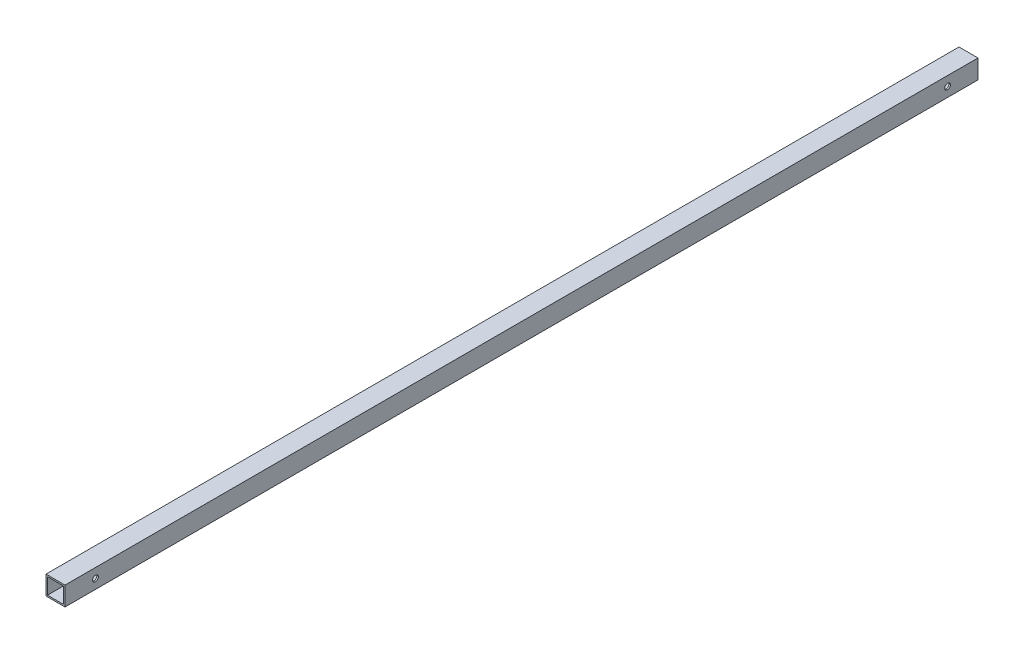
ISO-10303-21;
HEADER;
FILE_DESCRIPTION(('STEP AP214'),'2;1');
FILE_NAME('part.step','',(''),(''),'','','');
FILE_SCHEMA(('AUTOMOTIVE_DESIGN { 1 0 10303 214 1 1 1 1 }'));
ENDSEC;
DATA;
#1=APPLICATION_CONTEXT('core data for automotive mechanical design processes');
#2=APPLICATION_PROTOCOL_DEFINITION('international standard','automotive_design',2000,#1);
#3=PRODUCT_CONTEXT('',#1,'mechanical');
#4=PRODUCT('Part','Part','',(#3));
#5=PRODUCT_RELATED_PRODUCT_CATEGORY('part','',(#4));
#6=PRODUCT_DEFINITION_FORMATION('','',#4);
#7=PRODUCT_DEFINITION_CONTEXT('part definition',#1,'design');
#8=PRODUCT_DEFINITION('design','',#6,#7);
#9=PRODUCT_DEFINITION_SHAPE('','',#8);
#10=(LENGTH_UNIT() NAMED_UNIT(*) SI_UNIT(.MILLI.,.METRE.));
#11=(NAMED_UNIT(*) PLANE_ANGLE_UNIT() SI_UNIT($,.RADIAN.));
#12=(NAMED_UNIT(*) SI_UNIT($,.STERADIAN.) SOLID_ANGLE_UNIT());
#13=UNCERTAINTY_MEASURE_WITH_UNIT(LENGTH_MEASURE(1.E-05),#10,'distance_accuracy_value','');
#14=(GEOMETRIC_REPRESENTATION_CONTEXT(3) GLOBAL_UNCERTAINTY_ASSIGNED_CONTEXT((#13)) GLOBAL_UNIT_ASSIGNED_CONTEXT((#10,
#11,#12)) REPRESENTATION_CONTEXT('',''));
#15=CARTESIAN_POINT('',(0.,0.,0.));
#16=DIRECTION('',(0.,0.,1.));
#17=DIRECTION('',(1.,0.,0.));
#18=AXIS2_PLACEMENT_3D('',#15,#16,#17);
#19=CARTESIAN_POINT('',(0.,0.,762.));
#20=DIRECTION('',(0.,0.,-1.));
#21=DIRECTION('',(-1.,0.,0.));
#22=AXIS2_PLACEMENT_3D('',#19,#20,#21);
#23=PLANE('',#22);
#24=DIRECTION('',(0.,1.,0.));
#25=VECTOR('',#24,1.);
#26=CARTESIAN_POINT('',(15.875,-15.875,762.));
#27=LINE('',#26,#25);
#28=CARTESIAN_POINT('',(15.875,-15.875,762.));
#29=VERTEX_POINT('',#28);
#30=CARTESIAN_POINT('',(15.875,15.875,762.));
#31=VERTEX_POINT('',#30);
#32=EDGE_CURVE('E138',#29,#31,#27,.T.);
#33=ORIENTED_EDGE('',*,*,#32,.T.);
#34=DIRECTION('',(-1.,0.,0.));
#35=VECTOR('',#34,1.);
#36=CARTESIAN_POINT('',(-15.875,15.875,762.));
#37=LINE('',#36,#35);
#38=CARTESIAN_POINT('',(-15.875,15.875,762.));
#39=VERTEX_POINT('',#38);
#40=EDGE_CURVE('E141',#31,#39,#37,.T.);
#41=ORIENTED_EDGE('',*,*,#40,.T.);
#42=DIRECTION('',(0.,-1.,0.));
#43=VECTOR('',#42,1.);
#44=CARTESIAN_POINT('',(-15.875,-15.875,762.));
#45=LINE('',#44,#43);
#46=CARTESIAN_POINT('',(-15.875,-15.875,762.));
#47=VERTEX_POINT('',#46);
#48=EDGE_CURVE('E144',#39,#47,#45,.T.);
#49=ORIENTED_EDGE('',*,*,#48,.T.);
#50=DIRECTION('',(1.,0.,0.));
#51=VECTOR('',#50,1.);
#52=CARTESIAN_POINT('',(-15.875,-15.875,762.));
#53=LINE('',#52,#51);
#54=EDGE_CURVE('E146',#47,#29,#53,.T.);
#55=ORIENTED_EDGE('',*,*,#54,.T.);
#56=EDGE_LOOP('',(#33,#41,#49,#55));
#57=FACE_BOUND('',#56,.T.);
#58=DIRECTION('',(0.,-1.,0.));
#59=VECTOR('',#58,1.);
#60=CARTESIAN_POINT('',(-13.335,-13.335,762.));
#61=LINE('',#60,#59);
#62=CARTESIAN_POINT('',(-13.335,13.335,762.));
#63=VERTEX_POINT('',#62);
#64=CARTESIAN_POINT('',(-13.335,-13.335,762.));
#65=VERTEX_POINT('',#64);
#66=EDGE_CURVE('E100',#63,#65,#61,.T.);
#67=ORIENTED_EDGE('',*,*,#66,.F.);
#68=DIRECTION('',(-1.,0.,0.));
#69=VECTOR('',#68,1.);
#70=CARTESIAN_POINT('',(-13.335,13.335,762.));
#71=LINE('',#70,#69);
#72=CARTESIAN_POINT('',(13.335,13.335,762.));
#73=VERTEX_POINT('',#72);
#74=EDGE_CURVE('E122',#73,#63,#71,.T.);
#75=ORIENTED_EDGE('',*,*,#74,.F.);
#76=DIRECTION('',(0.,1.,0.));
#77=VECTOR('',#76,1.);
#78=CARTESIAN_POINT('',(13.335,-13.335,762.));
#79=LINE('',#78,#77);
#80=CARTESIAN_POINT('',(13.335,-13.335,762.));
#81=VERTEX_POINT('',#80);
#82=EDGE_CURVE('E120',#81,#73,#79,.T.);
#83=ORIENTED_EDGE('',*,*,#82,.F.);
#84=DIRECTION('',(1.,0.,0.));
#85=VECTOR('',#84,1.);
#86=CARTESIAN_POINT('',(-13.335,-13.335,762.));
#87=LINE('',#86,#85);
#88=EDGE_CURVE('E108',#65,#81,#87,.T.);
#89=ORIENTED_EDGE('',*,*,#88,.F.);
#90=EDGE_LOOP('',(#67,#75,#83,#89));
#91=FACE_BOUND('',#90,.T.);
#92=ADVANCED_FACE('F33',(#57,#91),#23,.F.);
#93=CARTESIAN_POINT('',(0.,0.,-762.));
#94=DIRECTION('',(0.,0.,-1.));
#95=DIRECTION('',(-1.,0.,0.));
#96=AXIS2_PLACEMENT_3D('',#93,#94,#95);
#97=PLANE('',#96);
#98=DIRECTION('',(0.,1.,0.));
#99=VECTOR('',#98,1.);
#100=CARTESIAN_POINT('',(15.875,-15.875,-762.));
#101=LINE('',#100,#99);
#102=CARTESIAN_POINT('',(15.875,-15.875,-762.));
#103=VERTEX_POINT('',#102);
#104=CARTESIAN_POINT('',(15.875,15.875,-762.));
#105=VERTEX_POINT('',#104);
#106=EDGE_CURVE('E116',#103,#105,#101,.T.);
#107=ORIENTED_EDGE('',*,*,#106,.F.);
#108=DIRECTION('',(1.,0.,0.));
#109=VECTOR('',#108,1.);
#110=CARTESIAN_POINT('',(-15.875,-15.875,-762.));
#111=LINE('',#110,#109);
#112=CARTESIAN_POINT('',(-15.875,-15.875,-762.));
#113=VERTEX_POINT('',#112);
#114=EDGE_CURVE('E142',#113,#103,#111,.T.);
#115=ORIENTED_EDGE('',*,*,#114,.F.);
#116=DIRECTION('',(0.,-1.,0.));
#117=VECTOR('',#116,1.);
#118=CARTESIAN_POINT('',(-15.875,-15.875,-762.));
#119=LINE('',#118,#117);
#120=CARTESIAN_POINT('',(-15.875,15.875,-762.));
#121=VERTEX_POINT('',#120);
#122=EDGE_CURVE('E153',#121,#113,#119,.T.);
#123=ORIENTED_EDGE('',*,*,#122,.F.);
#124=DIRECTION('',(-1.,0.,0.));
#125=VECTOR('',#124,1.);
#126=CARTESIAN_POINT('',(-15.875,15.875,-762.));
#127=LINE('',#126,#125);
#128=EDGE_CURVE('E151',#105,#121,#127,.T.);
#129=ORIENTED_EDGE('',*,*,#128,.F.);
#130=EDGE_LOOP('',(#107,#115,#123,#129));
#131=FACE_BOUND('',#130,.T.);
#132=DIRECTION('',(-1.,0.,0.));
#133=VECTOR('',#132,1.);
#134=CARTESIAN_POINT('',(-13.335,13.335,-762.));
#135=LINE('',#134,#133);
#136=CARTESIAN_POINT('',(13.335,13.335,-762.));
#137=VERTEX_POINT('',#136);
#138=CARTESIAN_POINT('',(-13.335,13.335,-762.));
#139=VERTEX_POINT('',#138);
#140=EDGE_CURVE('E109',#137,#139,#135,.T.);
#141=ORIENTED_EDGE('',*,*,#140,.T.);
#142=DIRECTION('',(0.,-1.,0.));
#143=VECTOR('',#142,1.);
#144=CARTESIAN_POINT('',(-13.335,-13.335,-762.));
#145=LINE('',#144,#143);
#146=CARTESIAN_POINT('',(-13.335,-13.335,-762.));
#147=VERTEX_POINT('',#146);
#148=EDGE_CURVE('E58',#139,#147,#145,.T.);
#149=ORIENTED_EDGE('',*,*,#148,.T.);
#150=DIRECTION('',(1.,0.,0.));
#151=VECTOR('',#150,1.);
#152=CARTESIAN_POINT('',(-13.335,-13.335,-762.));
#153=LINE('',#152,#151);
#154=CARTESIAN_POINT('',(13.335,-13.335,-762.));
#155=VERTEX_POINT('',#154);
#156=EDGE_CURVE('E115',#147,#155,#153,.T.);
#157=ORIENTED_EDGE('',*,*,#156,.T.);
#158=DIRECTION('',(0.,1.,0.));
#159=VECTOR('',#158,1.);
#160=CARTESIAN_POINT('',(13.335,-13.335,-762.));
#161=LINE('',#160,#159);
#162=EDGE_CURVE('E130',#155,#137,#161,.T.);
#163=ORIENTED_EDGE('',*,*,#162,.T.);
#164=EDGE_LOOP('',(#141,#149,#157,#163));
#165=FACE_BOUND('',#164,.T.);
#166=ADVANCED_FACE('F200',(#131,#165),#97,.T.);
#167=CARTESIAN_POINT('',(15.875,-15.875,762.));
#168=DIRECTION('',(-1.,0.,0.));
#169=DIRECTION('',(0.,0.,1.));
#170=AXIS2_PLACEMENT_3D('',#167,#168,#169);
#171=PLANE('',#170);
#172=CARTESIAN_POINT('',(15.875,0.,711.2));
#173=DIRECTION('',(1.,0.,0.));
#174=DIRECTION('',(0.,0.,-1.));
#175=AXIS2_PLACEMENT_3D('',#172,#173,#174);
#176=CIRCLE('',#175,4.76250000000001);
#177=CARTESIAN_POINT('',(15.875,0.,706.4375));
#178=VERTEX_POINT('',#177);
#179=EDGE_CURVE('E171',#178,#178,#176,.T.);
#180=ORIENTED_EDGE('',*,*,#179,.F.);
#181=EDGE_LOOP('',(#180));
#182=FACE_BOUND('',#181,.T.);
#183=CARTESIAN_POINT('',(15.875,0.,-711.2));
#184=DIRECTION('',(1.,0.,0.));
#185=DIRECTION('',(0.,0.,-1.));
#186=AXIS2_PLACEMENT_3D('',#183,#184,#185);
#187=CIRCLE('',#186,4.76250000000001);
#188=CARTESIAN_POINT('',(15.875,0.,-715.9625));
#189=VERTEX_POINT('',#188);
#190=EDGE_CURVE('E181',#189,#189,#187,.T.);
#191=ORIENTED_EDGE('',*,*,#190,.F.);
#192=EDGE_LOOP('',(#191));
#193=FACE_BOUND('',#192,.T.);
#194=ORIENTED_EDGE('',*,*,#106,.T.);
#195=DIRECTION('',(0.,0.,-1.));
#196=VECTOR('',#195,1.);
#197=CARTESIAN_POINT('',(15.875,15.875,762.));
#198=LINE('',#197,#196);
#199=EDGE_CURVE('E11',#31,#105,#198,.T.);
#200=ORIENTED_EDGE('',*,*,#199,.F.);
#201=ORIENTED_EDGE('',*,*,#32,.F.);
#202=DIRECTION('',(0.,0.,-1.));
#203=VECTOR('',#202,1.);
#204=CARTESIAN_POINT('',(15.875,-15.875,762.));
#205=LINE('',#204,#203);
#206=EDGE_CURVE('E148',#29,#103,#205,.T.);
#207=ORIENTED_EDGE('',*,*,#206,.T.);
#208=EDGE_LOOP('',(#194,#200,#201,#207));
#209=FACE_BOUND('',#208,.T.);
#210=ADVANCED_FACE('F35',(#182,#193,#209),#171,.F.);
#211=CARTESIAN_POINT('',(-15.875,15.875,762.));
#212=DIRECTION('',(0.,-1.,0.));
#213=DIRECTION('',(0.,0.,-1.));
#214=AXIS2_PLACEMENT_3D('',#211,#212,#213);
#215=PLANE('',#214);
#216=ORIENTED_EDGE('',*,*,#128,.T.);
#217=DIRECTION('',(0.,0.,-1.));
#218=VECTOR('',#217,1.);
#219=CARTESIAN_POINT('',(-15.875,15.875,762.));
#220=LINE('',#219,#218);
#221=EDGE_CURVE('E42',#39,#121,#220,.T.);
#222=ORIENTED_EDGE('',*,*,#221,.F.);
#223=ORIENTED_EDGE('',*,*,#40,.F.);
#224=ORIENTED_EDGE('',*,*,#199,.T.);
#225=EDGE_LOOP('',(#216,#222,#223,#224));
#226=FACE_BOUND('',#225,.T.);
#227=ADVANCED_FACE('F227',(#226),#215,.F.);
#228=CARTESIAN_POINT('',(-15.875,-15.875,762.));
#229=DIRECTION('',(1.,0.,0.));
#230=DIRECTION('',(0.,0.,-1.));
#231=AXIS2_PLACEMENT_3D('',#228,#229,#230);
#232=PLANE('',#231);
#233=CARTESIAN_POINT('',(-15.875,0.,711.2));
#234=DIRECTION('',(1.,0.,0.));
#235=DIRECTION('',(0.,0.,-1.));
#236=AXIS2_PLACEMENT_3D('',#233,#234,#235);
#237=CIRCLE('',#236,4.76250000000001);
#238=CARTESIAN_POINT('',(-15.875,0.,706.4375));
#239=VERTEX_POINT('',#238);
#240=EDGE_CURVE('E165',#239,#239,#237,.T.);
#241=ORIENTED_EDGE('',*,*,#240,.T.);
#242=EDGE_LOOP('',(#241));
#243=FACE_BOUND('',#242,.T.);
#244=CARTESIAN_POINT('',(-15.875,0.,-711.2));
#245=DIRECTION('',(1.,0.,0.));
#246=DIRECTION('',(0.,0.,-1.));
#247=AXIS2_PLACEMENT_3D('',#244,#245,#246);
#248=CIRCLE('',#247,4.76250000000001);
#249=CARTESIAN_POINT('',(-15.875,0.,-715.9625));
#250=VERTEX_POINT('',#249);
#251=EDGE_CURVE('E176',#250,#250,#248,.T.);
#252=ORIENTED_EDGE('',*,*,#251,.T.);
#253=EDGE_LOOP('',(#252));
#254=FACE_BOUND('',#253,.T.);
#255=ORIENTED_EDGE('',*,*,#122,.T.);
#256=DIRECTION('',(0.,0.,-1.));
#257=VECTOR('',#256,1.);
#258=CARTESIAN_POINT('',(-15.875,-15.875,762.));
#259=LINE('',#258,#257);
#260=EDGE_CURVE('E158',#47,#113,#259,.T.);
#261=ORIENTED_EDGE('',*,*,#260,.F.);
#262=ORIENTED_EDGE('',*,*,#48,.F.);
#263=ORIENTED_EDGE('',*,*,#221,.T.);
#264=EDGE_LOOP('',(#255,#261,#262,#263));
#265=FACE_BOUND('',#264,.T.);
#266=ADVANCED_FACE('F224',(#243,#254,#265),#232,.F.);
#267=CARTESIAN_POINT('',(-15.875,-15.875,762.));
#268=DIRECTION('',(0.,1.,0.));
#269=DIRECTION('',(0.,0.,1.));
#270=AXIS2_PLACEMENT_3D('',#267,#268,#269);
#271=PLANE('',#270);
#272=ORIENTED_EDGE('',*,*,#114,.T.);
#273=ORIENTED_EDGE('',*,*,#206,.F.);
#274=ORIENTED_EDGE('',*,*,#54,.F.);
#275=ORIENTED_EDGE('',*,*,#260,.T.);
#276=EDGE_LOOP('',(#272,#273,#274,#275));
#277=FACE_BOUND('',#276,.T.);
#278=ADVANCED_FACE('F221',(#277),#271,.F.);
#279=CARTESIAN_POINT('',(-13.335,-13.335,762.));
#280=DIRECTION('',(1.,0.,0.));
#281=DIRECTION('',(0.,0.,-1.));
#282=AXIS2_PLACEMENT_3D('',#279,#280,#281);
#283=PLANE('',#282);
#284=CARTESIAN_POINT('',(-13.335,0.,711.2));
#285=DIRECTION('',(1.,0.,0.));
#286=DIRECTION('',(0.,0.,-1.));
#287=AXIS2_PLACEMENT_3D('',#284,#285,#286);
#288=CIRCLE('',#287,4.76250000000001);
#289=CARTESIAN_POINT('',(-13.335,0.,706.4375));
#290=VERTEX_POINT('',#289);
#291=EDGE_CURVE('E128',#290,#290,#288,.T.);
#292=ORIENTED_EDGE('',*,*,#291,.F.);
#293=EDGE_LOOP('',(#292));
#294=FACE_BOUND('',#293,.T.);
#295=CARTESIAN_POINT('',(-13.335,0.,-711.2));
#296=DIRECTION('',(1.,0.,0.));
#297=DIRECTION('',(0.,0.,-1.));
#298=AXIS2_PLACEMENT_3D('',#295,#296,#297);
#299=CIRCLE('',#298,4.76250000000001);
#300=CARTESIAN_POINT('',(-13.335,0.,-715.9625));
#301=VERTEX_POINT('',#300);
#302=EDGE_CURVE('E164',#301,#301,#299,.T.);
#303=ORIENTED_EDGE('',*,*,#302,.F.);
#304=EDGE_LOOP('',(#303));
#305=FACE_BOUND('',#304,.T.);
#306=ORIENTED_EDGE('',*,*,#148,.F.);
#307=DIRECTION('',(0.,0.,-1.));
#308=VECTOR('',#307,1.);
#309=CARTESIAN_POINT('',(-13.335,13.335,762.));
#310=LINE('',#309,#308);
#311=EDGE_CURVE('E104',#63,#139,#310,.T.);
#312=ORIENTED_EDGE('',*,*,#311,.F.);
#313=ORIENTED_EDGE('',*,*,#66,.T.);
#314=DIRECTION('',(0.,0.,-1.));
#315=VECTOR('',#314,1.);
#316=CARTESIAN_POINT('',(-13.335,-13.335,762.));
#317=LINE('',#316,#315);
#318=EDGE_CURVE('E103',#65,#147,#317,.T.);
#319=ORIENTED_EDGE('',*,*,#318,.T.);
#320=EDGE_LOOP('',(#306,#312,#313,#319));
#321=FACE_BOUND('',#320,.T.);
#322=ADVANCED_FACE('F102',(#294,#305,#321),#283,.T.);
#323=CARTESIAN_POINT('',(-13.335,-13.335,762.));
#324=DIRECTION('',(0.,1.,0.));
#325=DIRECTION('',(0.,0.,1.));
#326=AXIS2_PLACEMENT_3D('',#323,#324,#325);
#327=PLANE('',#326);
#328=ORIENTED_EDGE('',*,*,#156,.F.);
#329=ORIENTED_EDGE('',*,*,#318,.F.);
#330=ORIENTED_EDGE('',*,*,#88,.T.);
#331=DIRECTION('',(0.,0.,-1.));
#332=VECTOR('',#331,1.);
#333=CARTESIAN_POINT('',(13.335,-13.335,762.));
#334=LINE('',#333,#332);
#335=EDGE_CURVE('E117',#81,#155,#334,.T.);
#336=ORIENTED_EDGE('',*,*,#335,.T.);
#337=EDGE_LOOP('',(#328,#329,#330,#336));
#338=FACE_BOUND('',#337,.T.);
#339=ADVANCED_FACE('F112',(#338),#327,.T.);
#340=CARTESIAN_POINT('',(13.335,-13.335,762.));
#341=DIRECTION('',(-1.,0.,0.));
#342=DIRECTION('',(0.,-1.,0.));
#343=AXIS2_PLACEMENT_3D('',#340,#341,#342);
#344=PLANE('',#343);
#345=CARTESIAN_POINT('',(13.335,0.,711.2));
#346=DIRECTION('',(-1.,0.,0.));
#347=DIRECTION('',(0.,-1.,0.));
#348=AXIS2_PLACEMENT_3D('',#345,#346,#347);
#349=CIRCLE('',#348,4.76250000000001);
#350=CARTESIAN_POINT('',(13.335,-4.76250000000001,711.2));
#351=VERTEX_POINT('',#350);
#352=EDGE_CURVE('E37',#351,#351,#349,.T.);
#353=ORIENTED_EDGE('',*,*,#352,.F.);
#354=EDGE_LOOP('',(#353));
#355=FACE_BOUND('',#354,.T.);
#356=CARTESIAN_POINT('',(13.335,0.,-711.2));
#357=DIRECTION('',(-1.,0.,0.));
#358=DIRECTION('',(0.,-1.,0.));
#359=AXIS2_PLACEMENT_3D('',#356,#357,#358);
#360=CIRCLE('',#359,4.76250000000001);
#361=CARTESIAN_POINT('',(13.335,-4.76250000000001,-711.2));
#362=VERTEX_POINT('',#361);
#363=EDGE_CURVE('E162',#362,#362,#360,.T.);
#364=ORIENTED_EDGE('',*,*,#363,.F.);
#365=EDGE_LOOP('',(#364));
#366=FACE_BOUND('',#365,.T.);
#367=ORIENTED_EDGE('',*,*,#162,.F.);
#368=ORIENTED_EDGE('',*,*,#335,.F.);
#369=ORIENTED_EDGE('',*,*,#82,.T.);
#370=DIRECTION('',(0.,0.,-1.));
#371=VECTOR('',#370,1.);
#372=CARTESIAN_POINT('',(13.335,13.335,762.));
#373=LINE('',#372,#371);
#374=EDGE_CURVE('E50',#73,#137,#373,.T.);
#375=ORIENTED_EDGE('',*,*,#374,.T.);
#376=EDGE_LOOP('',(#367,#368,#369,#375));
#377=FACE_BOUND('',#376,.T.);
#378=ADVANCED_FACE('F192',(#355,#366,#377),#344,.T.);
#379=CARTESIAN_POINT('',(-13.335,13.335,762.));
#380=DIRECTION('',(0.,-1.,0.));
#381=DIRECTION('',(0.,0.,-1.));
#382=AXIS2_PLACEMENT_3D('',#379,#380,#381);
#383=PLANE('',#382);
#384=ORIENTED_EDGE('',*,*,#140,.F.);
#385=ORIENTED_EDGE('',*,*,#374,.F.);
#386=ORIENTED_EDGE('',*,*,#74,.T.);
#387=ORIENTED_EDGE('',*,*,#311,.T.);
#388=EDGE_LOOP('',(#384,#385,#386,#387));
#389=FACE_BOUND('',#388,.T.);
#390=ADVANCED_FACE('F195',(#389),#383,.T.);
#391=CARTESIAN_POINT('',(-15.875,0.,-711.2));
#392=DIRECTION('',(1.,0.,0.));
#393=DIRECTION('',(0.,0.,-1.));
#394=AXIS2_PLACEMENT_3D('',#391,#392,#393);
#395=CYLINDRICAL_SURFACE('',#394,4.76250000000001);
#396=ORIENTED_EDGE('',*,*,#363,.T.);
#397=EDGE_LOOP('',(#396));
#398=FACE_BOUND('',#397,.T.);
#399=ORIENTED_EDGE('',*,*,#190,.T.);
#400=EDGE_LOOP('',(#399));
#401=FACE_BOUND('',#400,.T.);
#402=ADVANCED_FACE('F202',(#398,#401),#395,.F.);
#403=CARTESIAN_POINT('',(-15.875,0.,711.2));
#404=DIRECTION('',(1.,0.,0.));
#405=DIRECTION('',(0.,0.,-1.));
#406=AXIS2_PLACEMENT_3D('',#403,#404,#405);
#407=CYLINDRICAL_SURFACE('',#406,4.76250000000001);
#408=ORIENTED_EDGE('',*,*,#352,.T.);
#409=EDGE_LOOP('',(#408));
#410=FACE_BOUND('',#409,.T.);
#411=ORIENTED_EDGE('',*,*,#179,.T.);
#412=EDGE_LOOP('',(#411));
#413=FACE_BOUND('',#412,.T.);
#414=ADVANCED_FACE('F189',(#410,#413),#407,.F.);
#415=ORIENTED_EDGE('',*,*,#302,.T.);
#416=EDGE_LOOP('',(#415));
#417=FACE_BOUND('',#416,.T.);
#418=ORIENTED_EDGE('',*,*,#251,.F.);
#419=EDGE_LOOP('',(#418));
#420=FACE_BOUND('',#419,.T.);
#421=ADVANCED_FACE('F209',(#417,#420),#395,.F.);
#422=ORIENTED_EDGE('',*,*,#291,.T.);
#423=EDGE_LOOP('',(#422));
#424=FACE_BOUND('',#423,.T.);
#425=ORIENTED_EDGE('',*,*,#240,.F.);
#426=EDGE_LOOP('',(#425));
#427=FACE_BOUND('',#426,.T.);
#428=ADVANCED_FACE('F255',(#424,#427),#407,.F.);
#429=CLOSED_SHELL('',(#92,#166,#210,#227,#266,#278,#322,#339,#378,#390,#402,#414,#421,#428));
#430=MANIFOLD_SOLID_BREP('B2',#429);
#431=ADVANCED_BREP_SHAPE_REPRESENTATION('',(#18,#430),#14);
#432=SHAPE_DEFINITION_REPRESENTATION(#9,#431);
ENDSEC;
END-ISO-10303-21;
